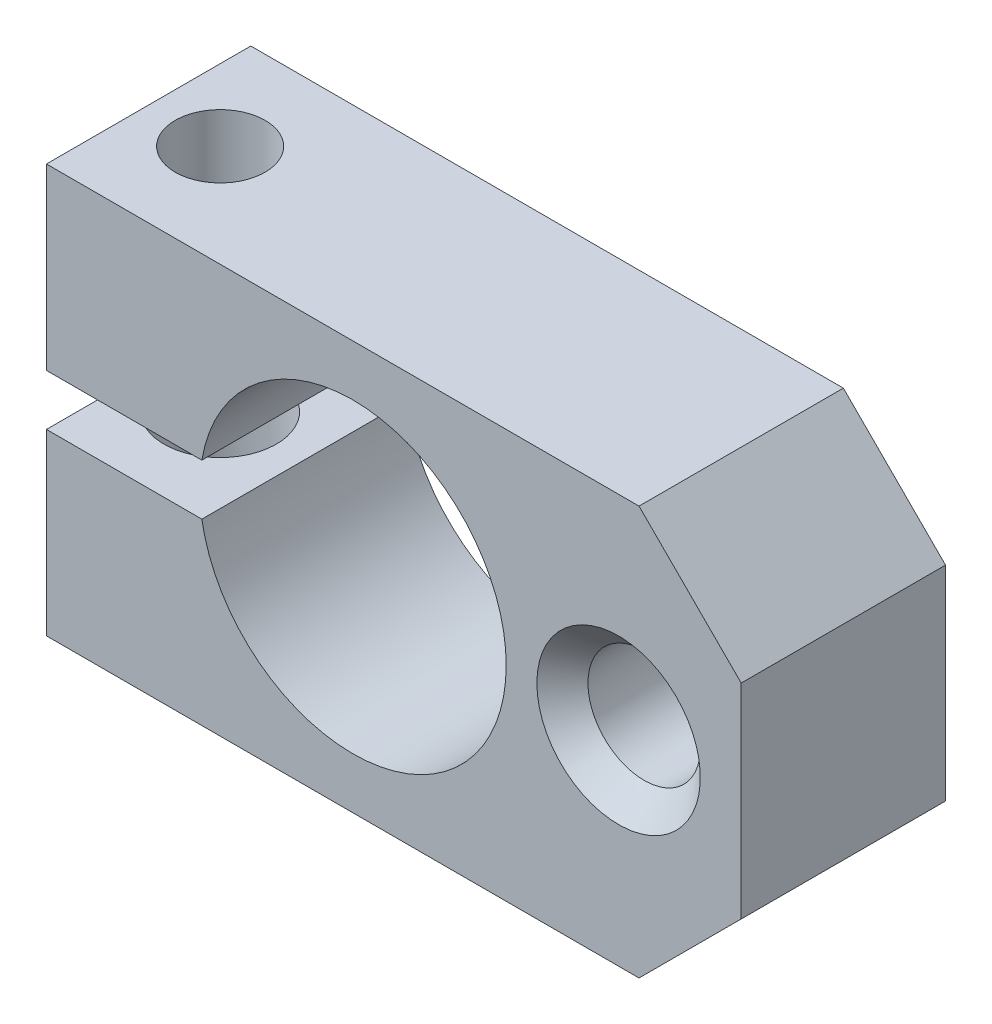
ISO-10303-21;
HEADER;
FILE_DESCRIPTION(('STEP AP214'),'2;1');
FILE_NAME('part.step','',(''),(''),'','','');
FILE_SCHEMA(('AUTOMOTIVE_DESIGN { 1 0 10303 214 1 1 1 1 }'));
ENDSEC;
DATA;
#1=APPLICATION_CONTEXT('core data for automotive mechanical design processes');
#2=APPLICATION_PROTOCOL_DEFINITION('international standard','automotive_design',2000,#1);
#3=PRODUCT_CONTEXT('',#1,'mechanical');
#4=PRODUCT('Part','Part','',(#3));
#5=PRODUCT_RELATED_PRODUCT_CATEGORY('part','',(#4));
#6=PRODUCT_DEFINITION_FORMATION('','',#4);
#7=PRODUCT_DEFINITION_CONTEXT('part definition',#1,'design');
#8=PRODUCT_DEFINITION('design','',#6,#7);
#9=PRODUCT_DEFINITION_SHAPE('','',#8);
#10=(LENGTH_UNIT() NAMED_UNIT(*) SI_UNIT(.MILLI.,.METRE.));
#11=(NAMED_UNIT(*) PLANE_ANGLE_UNIT() SI_UNIT($,.RADIAN.));
#12=(NAMED_UNIT(*) SI_UNIT($,.STERADIAN.) SOLID_ANGLE_UNIT());
#13=UNCERTAINTY_MEASURE_WITH_UNIT(LENGTH_MEASURE(1.E-05),#10,'distance_accuracy_value','');
#14=(GEOMETRIC_REPRESENTATION_CONTEXT(3) GLOBAL_UNCERTAINTY_ASSIGNED_CONTEXT((#13)) GLOBAL_UNIT_ASSIGNED_CONTEXT((#10,
#11,#12)) REPRESENTATION_CONTEXT('',''));
#15=CARTESIAN_POINT('',(0.,0.,0.));
#16=DIRECTION('',(0.,0.,1.));
#17=DIRECTION('',(1.,0.,0.));
#18=AXIS2_PLACEMENT_3D('',#15,#16,#17);
#19=CARTESIAN_POINT('',(-30.,-2.5,10.));
#20=DIRECTION('',(1.,0.,0.));
#21=DIRECTION('',(0.,0.,-1.));
#22=AXIS2_PLACEMENT_3D('',#19,#20,#21);
#23=PLANE('',#22);
#24=DIRECTION('',(0.,-1.,0.));
#25=VECTOR('',#24,1.);
#26=CARTESIAN_POINT('',(-30.,-2.5,-10.));
#27=LINE('',#26,#25);
#28=CARTESIAN_POINT('',(-30.,-2.5,-10.));
#29=VERTEX_POINT('',#28);
#30=CARTESIAN_POINT('',(-30.,-20.,-10.));
#31=VERTEX_POINT('',#30);
#32=EDGE_CURVE('E100',#29,#31,#27,.T.);
#33=ORIENTED_EDGE('',*,*,#32,.T.);
#34=DIRECTION('',(0.,0.,-1.));
#35=VECTOR('',#34,1.);
#36=CARTESIAN_POINT('',(-30.,-20.,10.));
#37=LINE('',#36,#35);
#38=CARTESIAN_POINT('',(-30.,-20.,10.));
#39=VERTEX_POINT('',#38);
#40=EDGE_CURVE('E106',#39,#31,#37,.T.);
#41=ORIENTED_EDGE('',*,*,#40,.F.);
#42=DIRECTION('',(0.,-1.,0.));
#43=VECTOR('',#42,1.);
#44=CARTESIAN_POINT('',(-30.,-2.5,10.));
#45=LINE('',#44,#43);
#46=CARTESIAN_POINT('',(-30.,-2.5,10.));
#47=VERTEX_POINT('',#46);
#48=EDGE_CURVE('E133',#47,#39,#45,.T.);
#49=ORIENTED_EDGE('',*,*,#48,.F.);
#50=DIRECTION('',(0.,0.,-1.));
#51=VECTOR('',#50,1.);
#52=CARTESIAN_POINT('',(-30.,-2.5,10.));
#53=LINE('',#52,#51);
#54=EDGE_CURVE('E117',#47,#29,#53,.T.);
#55=ORIENTED_EDGE('',*,*,#54,.T.);
#56=EDGE_LOOP('',(#33,#41,#49,#55));
#57=FACE_BOUND('',#56,.T.);
#58=ADVANCED_FACE('F17',(#57),#23,.F.);
#59=CARTESIAN_POINT('',(-30.,-20.,10.));
#60=DIRECTION('',(0.,1.,0.));
#61=DIRECTION('',(0.,0.,1.));
#62=AXIS2_PLACEMENT_3D('',#59,#60,#61);
#63=PLANE('',#62);
#64=CARTESIAN_POINT('',(-23.,-20.,0.));
#65=DIRECTION('',(0.,-1.,0.));
#66=DIRECTION('',(0.,0.,-1.));
#67=AXIS2_PLACEMENT_3D('',#64,#65,#66);
#68=CIRCLE('',#67,5.5);
#69=CARTESIAN_POINT('',(-23.,-20.,-5.5));
#70=VERTEX_POINT('',#69);
#71=EDGE_CURVE('E125',#70,#70,#68,.T.);
#72=ORIENTED_EDGE('',*,*,#71,.F.);
#73=EDGE_LOOP('',(#72));
#74=FACE_BOUND('',#73,.T.);
#75=DIRECTION('',(1.,0.,0.));
#76=VECTOR('',#75,1.);
#77=CARTESIAN_POINT('',(-30.,-20.,-10.));
#78=LINE('',#77,#76);
#79=CARTESIAN_POINT('',(28.,-20.,-10.));
#80=VERTEX_POINT('',#79);
#81=EDGE_CURVE('E94',#31,#80,#78,.T.);
#82=ORIENTED_EDGE('',*,*,#81,.T.);
#83=DIRECTION('',(0.,0.,1.));
#84=VECTOR('',#83,1.);
#85=CARTESIAN_POINT('',(28.,-20.,10.));
#86=LINE('',#85,#84);
#87=CARTESIAN_POINT('',(28.,-20.,10.));
#88=VERTEX_POINT('',#87);
#89=EDGE_CURVE('E39',#80,#88,#86,.T.);
#90=ORIENTED_EDGE('',*,*,#89,.T.);
#91=DIRECTION('',(1.,0.,0.));
#92=VECTOR('',#91,1.);
#93=CARTESIAN_POINT('',(-30.,-20.,10.));
#94=LINE('',#93,#92);
#95=EDGE_CURVE('E108',#39,#88,#94,.T.);
#96=ORIENTED_EDGE('',*,*,#95,.F.);
#97=ORIENTED_EDGE('',*,*,#40,.T.);
#98=EDGE_LOOP('',(#82,#90,#96,#97));
#99=FACE_BOUND('',#98,.T.);
#100=ADVANCED_FACE('F107',(#74,#99),#63,.F.);
#101=CARTESIAN_POINT('',(38.,-20.,10.));
#102=DIRECTION('',(-1.,0.,0.));
#103=DIRECTION('',(0.,0.,1.));
#104=AXIS2_PLACEMENT_3D('',#101,#102,#103);
#105=PLANE('',#104);
#106=DIRECTION('',(0.,1.,0.));
#107=VECTOR('',#106,1.);
#108=CARTESIAN_POINT('',(38.,-20.,10.));
#109=LINE('',#108,#107);
#110=CARTESIAN_POINT('',(38.,-10.,10.));
#111=VERTEX_POINT('',#110);
#112=CARTESIAN_POINT('',(38.,9.99999999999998,10.));
#113=VERTEX_POINT('',#112);
#114=EDGE_CURVE('E132',#111,#113,#109,.T.);
#115=ORIENTED_EDGE('',*,*,#114,.F.);
#116=DIRECTION('',(0.,0.,-1.));
#117=VECTOR('',#116,1.);
#118=CARTESIAN_POINT('',(38.,-10.,10.));
#119=LINE('',#118,#117);
#120=CARTESIAN_POINT('',(38.,-10.,-10.));
#121=VERTEX_POINT('',#120);
#122=EDGE_CURVE('E171',#111,#121,#119,.T.);
#123=ORIENTED_EDGE('',*,*,#122,.T.);
#124=DIRECTION('',(0.,1.,0.));
#125=VECTOR('',#124,1.);
#126=CARTESIAN_POINT('',(38.,-20.,-10.));
#127=LINE('',#126,#125);
#128=CARTESIAN_POINT('',(38.,10.,-10.));
#129=VERTEX_POINT('',#128);
#130=EDGE_CURVE('E103',#121,#129,#127,.T.);
#131=ORIENTED_EDGE('',*,*,#130,.T.);
#132=DIRECTION('',(0.,0.,1.));
#133=VECTOR('',#132,1.);
#134=CARTESIAN_POINT('',(38.,10.,10.));
#135=LINE('',#134,#133);
#136=EDGE_CURVE('E169',#129,#113,#135,.T.);
#137=ORIENTED_EDGE('',*,*,#136,.T.);
#138=EDGE_LOOP('',(#115,#123,#131,#137));
#139=FACE_BOUND('',#138,.T.);
#140=ADVANCED_FACE('F184',(#139),#105,.F.);
#141=CARTESIAN_POINT('',(38.,20.,10.));
#142=DIRECTION('',(0.,-1.,0.));
#143=DIRECTION('',(1.,0.,0.));
#144=AXIS2_PLACEMENT_3D('',#141,#142,#143);
#145=PLANE('',#144);
#146=CARTESIAN_POINT('',(-23.,20.,0.));
#147=DIRECTION('',(0.,1.,0.));
#148=DIRECTION('',(0.,0.,1.));
#149=AXIS2_PLACEMENT_3D('',#146,#147,#148);
#150=CIRCLE('',#149,4.4);
#151=CARTESIAN_POINT('',(-23.,20.,4.4));
#152=VERTEX_POINT('',#151);
#153=EDGE_CURVE('E263',#152,#152,#150,.T.);
#154=ORIENTED_EDGE('',*,*,#153,.F.);
#155=EDGE_LOOP('',(#154));
#156=FACE_BOUND('',#155,.T.);
#157=DIRECTION('',(-1.,0.,0.));
#158=VECTOR('',#157,1.);
#159=CARTESIAN_POINT('',(38.,20.,10.));
#160=LINE('',#159,#158);
#161=CARTESIAN_POINT('',(28.,20.,10.));
#162=VERTEX_POINT('',#161);
#163=CARTESIAN_POINT('',(-30.,20.,10.));
#164=VERTEX_POINT('',#163);
#165=EDGE_CURVE('E135',#162,#164,#160,.T.);
#166=ORIENTED_EDGE('',*,*,#165,.F.);
#167=DIRECTION('',(0.,0.,-1.));
#168=VECTOR('',#167,1.);
#169=CARTESIAN_POINT('',(28.,20.,10.));
#170=LINE('',#169,#168);
#171=CARTESIAN_POINT('',(28.,20.,-10.));
#172=VERTEX_POINT('',#171);
#173=EDGE_CURVE('E11',#162,#172,#170,.T.);
#174=ORIENTED_EDGE('',*,*,#173,.T.);
#175=DIRECTION('',(-1.,0.,0.));
#176=VECTOR('',#175,1.);
#177=CARTESIAN_POINT('',(38.,20.,-10.));
#178=LINE('',#177,#176);
#179=CARTESIAN_POINT('',(-30.,20.,-10.));
#180=VERTEX_POINT('',#179);
#181=EDGE_CURVE('E269',#172,#180,#178,.T.);
#182=ORIENTED_EDGE('',*,*,#181,.T.);
#183=DIRECTION('',(0.,0.,-1.));
#184=VECTOR('',#183,1.);
#185=CARTESIAN_POINT('',(-30.,20.,10.));
#186=LINE('',#185,#184);
#187=EDGE_CURVE('E113',#164,#180,#186,.T.);
#188=ORIENTED_EDGE('',*,*,#187,.F.);
#189=EDGE_LOOP('',(#166,#174,#182,#188));
#190=FACE_BOUND('',#189,.T.);
#191=ADVANCED_FACE('F210',(#156,#190),#145,.F.);
#192=CARTESIAN_POINT('',(-30.,20.,10.));
#193=DIRECTION('',(1.,0.,0.));
#194=DIRECTION('',(0.,0.,-1.));
#195=AXIS2_PLACEMENT_3D('',#192,#193,#194);
#196=PLANE('',#195);
#197=DIRECTION('',(0.,-1.,0.));
#198=VECTOR('',#197,1.);
#199=CARTESIAN_POINT('',(-30.,20.,-10.));
#200=LINE('',#199,#198);
#201=CARTESIAN_POINT('',(-30.,2.5,-10.));
#202=VERTEX_POINT('',#201);
#203=EDGE_CURVE('E272',#180,#202,#200,.T.);
#204=ORIENTED_EDGE('',*,*,#203,.T.);
#205=DIRECTION('',(0.,0.,-1.));
#206=VECTOR('',#205,1.);
#207=CARTESIAN_POINT('',(-30.,2.5,10.));
#208=LINE('',#207,#206);
#209=CARTESIAN_POINT('',(-30.,2.5,10.));
#210=VERTEX_POINT('',#209);
#211=EDGE_CURVE('E153',#210,#202,#208,.T.);
#212=ORIENTED_EDGE('',*,*,#211,.F.);
#213=DIRECTION('',(0.,-1.,0.));
#214=VECTOR('',#213,1.);
#215=CARTESIAN_POINT('',(-30.,20.,10.));
#216=LINE('',#215,#214);
#217=EDGE_CURVE('E137',#164,#210,#216,.T.);
#218=ORIENTED_EDGE('',*,*,#217,.F.);
#219=ORIENTED_EDGE('',*,*,#187,.T.);
#220=EDGE_LOOP('',(#204,#212,#218,#219));
#221=FACE_BOUND('',#220,.T.);
#222=ADVANCED_FACE('F216',(#221),#196,.F.);
#223=CARTESIAN_POINT('',(-30.,2.5,10.));
#224=DIRECTION('',(0.,1.,0.));
#225=DIRECTION('',(0.,0.,1.));
#226=AXIS2_PLACEMENT_3D('',#223,#224,#225);
#227=PLANE('',#226);
#228=CARTESIAN_POINT('',(-23.,2.5,0.));
#229=DIRECTION('',(0.,1.,0.));
#230=DIRECTION('',(0.,0.,1.));
#231=AXIS2_PLACEMENT_3D('',#228,#229,#230);
#232=CIRCLE('',#231,4.4);
#233=CARTESIAN_POINT('',(-23.,2.5,4.4));
#234=VERTEX_POINT('',#233);
#235=EDGE_CURVE('E258',#234,#234,#232,.T.);
#236=ORIENTED_EDGE('',*,*,#235,.T.);
#237=EDGE_LOOP('',(#236));
#238=FACE_BOUND('',#237,.T.);
#239=DIRECTION('',(1.,0.,0.));
#240=VECTOR('',#239,1.);
#241=CARTESIAN_POINT('',(-30.,2.5,-10.));
#242=LINE('',#241,#240);
#243=CARTESIAN_POINT('',(-14.790199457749,2.5,-10.));
#244=VERTEX_POINT('',#243);
#245=EDGE_CURVE('E275',#202,#244,#242,.T.);
#246=ORIENTED_EDGE('',*,*,#245,.T.);
#247=DIRECTION('',(0.,0.,-1.));
#248=VECTOR('',#247,1.);
#249=CARTESIAN_POINT('',(-14.790199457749,2.5,10.));
#250=LINE('',#249,#248);
#251=CARTESIAN_POINT('',(-14.790199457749,2.5,10.));
#252=VERTEX_POINT('',#251);
#253=EDGE_CURVE('E150',#252,#244,#250,.T.);
#254=ORIENTED_EDGE('',*,*,#253,.F.);
#255=DIRECTION('',(1.,0.,0.));
#256=VECTOR('',#255,1.);
#257=CARTESIAN_POINT('',(-30.,2.5,10.));
#258=LINE('',#257,#256);
#259=EDGE_CURVE('E139',#210,#252,#258,.T.);
#260=ORIENTED_EDGE('',*,*,#259,.F.);
#261=ORIENTED_EDGE('',*,*,#211,.T.);
#262=EDGE_LOOP('',(#246,#254,#260,#261));
#263=FACE_BOUND('',#262,.T.);
#264=ADVANCED_FACE('F220',(#238,#263),#227,.F.);
#265=CARTESIAN_POINT('',(0.,0.,10.));
#266=DIRECTION('',(0.,0.,-1.));
#267=DIRECTION('',(-1.,0.,0.));
#268=AXIS2_PLACEMENT_3D('',#265,#266,#267);
#269=CYLINDRICAL_SURFACE('',#268,15.);
#270=CARTESIAN_POINT('',(0.,0.,-10.));
#271=DIRECTION('',(0.,0.,-1.));
#272=DIRECTION('',(-1.,0.,0.));
#273=AXIS2_PLACEMENT_3D('',#270,#271,#272);
#274=CIRCLE('',#273,15.);
#275=CARTESIAN_POINT('',(-14.790199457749,-2.5,-10.));
#276=VERTEX_POINT('',#275);
#277=EDGE_CURVE('E277',#244,#276,#274,.T.);
#278=ORIENTED_EDGE('',*,*,#277,.T.);
#279=DIRECTION('',(0.,0.,-1.));
#280=VECTOR('',#279,1.);
#281=CARTESIAN_POINT('',(-14.790199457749,-2.5,10.));
#282=LINE('',#281,#280);
#283=CARTESIAN_POINT('',(-14.790199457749,-2.5,10.));
#284=VERTEX_POINT('',#283);
#285=EDGE_CURVE('E147',#284,#276,#282,.T.);
#286=ORIENTED_EDGE('',*,*,#285,.F.);
#287=CARTESIAN_POINT('',(0.,0.,10.));
#288=DIRECTION('',(0.,0.,-1.));
#289=DIRECTION('',(-1.,0.,0.));
#290=AXIS2_PLACEMENT_3D('',#287,#288,#289);
#291=CIRCLE('',#290,15.);
#292=EDGE_CURVE('E141',#252,#284,#291,.T.);
#293=ORIENTED_EDGE('',*,*,#292,.F.);
#294=ORIENTED_EDGE('',*,*,#253,.T.);
#295=EDGE_LOOP('',(#278,#286,#293,#294));
#296=FACE_BOUND('',#295,.T.);
#297=ADVANCED_FACE('F224',(#296),#269,.F.);
#298=CARTESIAN_POINT('',(26.,0.,10.));
#299=DIRECTION('',(0.,0.,-1.));
#300=DIRECTION('',(-1.,0.,0.));
#301=AXIS2_PLACEMENT_3D('',#298,#299,#300);
#302=CYLINDRICAL_SURFACE('',#301,5.5);
#303=CARTESIAN_POINT('',(26.,0.,-7.5));
#304=DIRECTION('',(0.,0.,-1.));
#305=DIRECTION('',(-1.,0.,0.));
#306=AXIS2_PLACEMENT_3D('',#303,#304,#305);
#307=CIRCLE('',#306,5.5);
#308=CARTESIAN_POINT('',(20.5,0.,-7.5));
#309=VERTEX_POINT('',#308);
#310=EDGE_CURVE('E160',#309,#309,#307,.T.);
#311=ORIENTED_EDGE('',*,*,#310,.T.);
#312=EDGE_LOOP('',(#311));
#313=FACE_BOUND('',#312,.T.);
#314=CARTESIAN_POINT('',(26.,0.,7.5));
#315=DIRECTION('',(0.,0.,-1.));
#316=DIRECTION('',(-1.,0.,0.));
#317=AXIS2_PLACEMENT_3D('',#314,#315,#316);
#318=CIRCLE('',#317,5.5);
#319=CARTESIAN_POINT('',(20.5,0.,7.5));
#320=VERTEX_POINT('',#319);
#321=EDGE_CURVE('E112',#320,#320,#318,.F.);
#322=ORIENTED_EDGE('',*,*,#321,.T.);
#323=EDGE_LOOP('',(#322));
#324=FACE_BOUND('',#323,.T.);
#325=ADVANCED_FACE('F228',(#313,#324),#302,.F.);
#326=CARTESIAN_POINT('',(-30.,-2.5,10.));
#327=DIRECTION('',(0.,-1.,0.));
#328=DIRECTION('',(0.,0.,-1.));
#329=AXIS2_PLACEMENT_3D('',#326,#327,#328);
#330=PLANE('',#329);
#331=CARTESIAN_POINT('',(-23.,-2.5,0.));
#332=DIRECTION('',(0.,-1.,0.));
#333=DIRECTION('',(0.,0.,-1.));
#334=AXIS2_PLACEMENT_3D('',#331,#332,#333);
#335=CIRCLE('',#334,5.5);
#336=CARTESIAN_POINT('',(-23.,-2.5,-5.5));
#337=VERTEX_POINT('',#336);
#338=EDGE_CURVE('E119',#337,#337,#335,.T.);
#339=ORIENTED_EDGE('',*,*,#338,.T.);
#340=EDGE_LOOP('',(#339));
#341=FACE_BOUND('',#340,.T.);
#342=DIRECTION('',(-1.,0.,0.));
#343=VECTOR('',#342,1.);
#344=CARTESIAN_POINT('',(-30.,-2.5,-10.));
#345=LINE('',#344,#343);
#346=EDGE_CURVE('E129',#276,#29,#345,.T.);
#347=ORIENTED_EDGE('',*,*,#346,.T.);
#348=ORIENTED_EDGE('',*,*,#54,.F.);
#349=DIRECTION('',(-1.,0.,0.));
#350=VECTOR('',#349,1.);
#351=CARTESIAN_POINT('',(-30.,-2.5,10.));
#352=LINE('',#351,#350);
#353=EDGE_CURVE('E143',#284,#47,#352,.T.);
#354=ORIENTED_EDGE('',*,*,#353,.F.);
#355=ORIENTED_EDGE('',*,*,#285,.T.);
#356=EDGE_LOOP('',(#347,#348,#354,#355));
#357=FACE_BOUND('',#356,.T.);
#358=ADVANCED_FACE('F230',(#341,#357),#330,.F.);
#359=CARTESIAN_POINT('',(0.,0.,10.));
#360=DIRECTION('',(0.,0.,-1.));
#361=DIRECTION('',(-1.,0.,0.));
#362=AXIS2_PLACEMENT_3D('',#359,#360,#361);
#363=PLANE('',#362);
#364=CARTESIAN_POINT('',(26.,0.,10.));
#365=DIRECTION('',(0.,0.,-1.));
#366=DIRECTION('',(-1.,0.,0.));
#367=AXIS2_PLACEMENT_3D('',#364,#365,#366);
#368=CIRCLE('',#367,8.);
#369=CARTESIAN_POINT('',(18.,0.,10.));
#370=VERTEX_POINT('',#369);
#371=EDGE_CURVE('E166',#370,#370,#368,.T.);
#372=ORIENTED_EDGE('',*,*,#371,.T.);
#373=EDGE_LOOP('',(#372));
#374=FACE_BOUND('',#373,.T.);
#375=ORIENTED_EDGE('',*,*,#95,.T.);
#376=DIRECTION('',(-0.707106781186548,-0.707106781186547,0.));
#377=VECTOR('',#376,1.);
#378=CARTESIAN_POINT('',(38.,-10.,10.));
#379=LINE('',#378,#377);
#380=EDGE_CURVE('E24',#88,#111,#379,.F.);
#381=ORIENTED_EDGE('',*,*,#380,.T.);
#382=ORIENTED_EDGE('',*,*,#114,.T.);
#383=DIRECTION('',(0.707106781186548,-0.707106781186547,0.));
#384=VECTOR('',#383,1.);
#385=CARTESIAN_POINT('',(28.,20.,10.));
#386=LINE('',#385,#384);
#387=EDGE_CURVE('E31',#113,#162,#386,.F.);
#388=ORIENTED_EDGE('',*,*,#387,.T.);
#389=ORIENTED_EDGE('',*,*,#165,.T.);
#390=ORIENTED_EDGE('',*,*,#217,.T.);
#391=ORIENTED_EDGE('',*,*,#259,.T.);
#392=ORIENTED_EDGE('',*,*,#292,.T.);
#393=ORIENTED_EDGE('',*,*,#353,.T.);
#394=ORIENTED_EDGE('',*,*,#48,.T.);
#395=EDGE_LOOP('',(#375,#381,#382,#388,#389,#390,#391,#392,#393,#394));
#396=FACE_BOUND('',#395,.T.);
#397=ADVANCED_FACE('F180',(#374,#396),#363,.F.);
#398=CARTESIAN_POINT('',(0.,0.,-10.));
#399=DIRECTION('',(0.,0.,-1.));
#400=DIRECTION('',(-1.,0.,0.));
#401=AXIS2_PLACEMENT_3D('',#398,#399,#400);
#402=PLANE('',#401);
#403=CARTESIAN_POINT('',(26.,0.,-10.));
#404=DIRECTION('',(0.,0.,-1.));
#405=DIRECTION('',(-1.,0.,0.));
#406=AXIS2_PLACEMENT_3D('',#403,#404,#405);
#407=CIRCLE('',#406,8.);
#408=CARTESIAN_POINT('',(18.,0.,-10.));
#409=VERTEX_POINT('',#408);
#410=EDGE_CURVE('E163',#409,#409,#407,.F.);
#411=ORIENTED_EDGE('',*,*,#410,.T.);
#412=EDGE_LOOP('',(#411));
#413=FACE_BOUND('',#412,.T.);
#414=ORIENTED_EDGE('',*,*,#130,.F.);
#415=DIRECTION('',(0.707106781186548,0.707106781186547,0.));
#416=VECTOR('',#415,1.);
#417=CARTESIAN_POINT('',(24.,-24.,-10.));
#418=LINE('',#417,#416);
#419=EDGE_CURVE('E101',#121,#80,#418,.F.);
#420=ORIENTED_EDGE('',*,*,#419,.T.);
#421=ORIENTED_EDGE('',*,*,#81,.F.);
#422=ORIENTED_EDGE('',*,*,#32,.F.);
#423=ORIENTED_EDGE('',*,*,#346,.F.);
#424=ORIENTED_EDGE('',*,*,#277,.F.);
#425=ORIENTED_EDGE('',*,*,#245,.F.);
#426=ORIENTED_EDGE('',*,*,#203,.F.);
#427=ORIENTED_EDGE('',*,*,#181,.F.);
#428=DIRECTION('',(-0.707106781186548,0.707106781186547,0.));
#429=VECTOR('',#428,1.);
#430=CARTESIAN_POINT('',(24.,24.,-10.));
#431=LINE('',#430,#429);
#432=EDGE_CURVE('E174',#172,#129,#431,.F.);
#433=ORIENTED_EDGE('',*,*,#432,.T.);
#434=EDGE_LOOP('',(#414,#420,#421,#422,#423,#424,#425,#426,#427,#433));
#435=FACE_BOUND('',#434,.T.);
#436=ADVANCED_FACE('F97',(#413,#435),#402,.T.);
#437=CARTESIAN_POINT('',(26.,0.,-7.5));
#438=DIRECTION('',(0.,0.,-1.));
#439=DIRECTION('',(-1.,0.,0.));
#440=AXIS2_PLACEMENT_3D('',#437,#438,#439);
#441=CONICAL_SURFACE('',#440,5.5,0.785398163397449);
#442=ORIENTED_EDGE('',*,*,#410,.F.);
#443=EDGE_LOOP('',(#442));
#444=FACE_BOUND('',#443,.T.);
#445=ORIENTED_EDGE('',*,*,#310,.F.);
#446=EDGE_LOOP('',(#445));
#447=FACE_BOUND('',#446,.T.);
#448=ADVANCED_FACE('F242',(#444,#447),#441,.F.);
#449=CARTESIAN_POINT('',(26.,0.,10.));
#450=DIRECTION('',(0.,0.,1.));
#451=DIRECTION('',(1.,0.,0.));
#452=AXIS2_PLACEMENT_3D('',#449,#450,#451);
#453=CONICAL_SURFACE('',#452,8.,0.785398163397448);
#454=ORIENTED_EDGE('',*,*,#321,.F.);
#455=EDGE_LOOP('',(#454));
#456=FACE_BOUND('',#455,.T.);
#457=ORIENTED_EDGE('',*,*,#371,.F.);
#458=EDGE_LOOP('',(#457));
#459=FACE_BOUND('',#458,.T.);
#460=ADVANCED_FACE('F246',(#456,#459),#453,.F.);
#461=CARTESIAN_POINT('',(-23.,61.3879597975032,0.));
#462=DIRECTION('',(0.,-1.,0.));
#463=DIRECTION('',(0.,0.,-1.));
#464=AXIS2_PLACEMENT_3D('',#461,#462,#463);
#465=CYLINDRICAL_SURFACE('',#464,5.5);
#466=ORIENTED_EDGE('',*,*,#338,.F.);
#467=EDGE_LOOP('',(#466));
#468=FACE_BOUND('',#467,.T.);
#469=ORIENTED_EDGE('',*,*,#71,.T.);
#470=EDGE_LOOP('',(#469));
#471=FACE_BOUND('',#470,.T.);
#472=ADVANCED_FACE('F199',(#468,#471),#465,.F.);
#473=CARTESIAN_POINT('',(-23.,-61.3879597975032,0.));
#474=DIRECTION('',(0.,1.,0.));
#475=DIRECTION('',(0.,0.,1.));
#476=AXIS2_PLACEMENT_3D('',#473,#474,#475);
#477=CYLINDRICAL_SURFACE('',#476,4.4);
#478=ORIENTED_EDGE('',*,*,#235,.F.);
#479=EDGE_LOOP('',(#478));
#480=FACE_BOUND('',#479,.T.);
#481=ORIENTED_EDGE('',*,*,#153,.T.);
#482=EDGE_LOOP('',(#481));
#483=FACE_BOUND('',#482,.T.);
#484=ADVANCED_FACE('F190',(#480,#483),#477,.F.);
#485=CARTESIAN_POINT('',(38.,-10.,10.));
#486=DIRECTION('',(-0.707106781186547,0.707106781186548,0.));
#487=DIRECTION('',(-0.707106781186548,-0.707106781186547,0.));
#488=AXIS2_PLACEMENT_3D('',#485,#486,#487);
#489=PLANE('',#488);
#490=ORIENTED_EDGE('',*,*,#380,.F.);
#491=ORIENTED_EDGE('',*,*,#89,.F.);
#492=ORIENTED_EDGE('',*,*,#419,.F.);
#493=ORIENTED_EDGE('',*,*,#122,.F.);
#494=EDGE_LOOP('',(#490,#491,#492,#493));
#495=FACE_BOUND('',#494,.T.);
#496=ADVANCED_FACE('F187',(#495),#489,.F.);
#497=CARTESIAN_POINT('',(28.,20.,10.));
#498=DIRECTION('',(-0.707106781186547,-0.707106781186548,0.));
#499=DIRECTION('',(0.707106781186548,-0.707106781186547,0.));
#500=AXIS2_PLACEMENT_3D('',#497,#498,#499);
#501=PLANE('',#500);
#502=ORIENTED_EDGE('',*,*,#387,.F.);
#503=ORIENTED_EDGE('',*,*,#136,.F.);
#504=ORIENTED_EDGE('',*,*,#432,.F.);
#505=ORIENTED_EDGE('',*,*,#173,.F.);
#506=EDGE_LOOP('',(#502,#503,#504,#505));
#507=FACE_BOUND('',#506,.T.);
#508=ADVANCED_FACE('F189',(#507),#501,.F.);
#509=CLOSED_SHELL('',(#58,#100,#140,#191,#222,#264,#297,#325,#358,#397,#436,#448,#460,#472,#484,
#496,#508));
#510=MANIFOLD_SOLID_BREP('B1',#509);
#511=ADVANCED_BREP_SHAPE_REPRESENTATION('',(#18,#510),#14);
#512=SHAPE_DEFINITION_REPRESENTATION(#9,#511);
ENDSEC;
END-ISO-10303-21;
